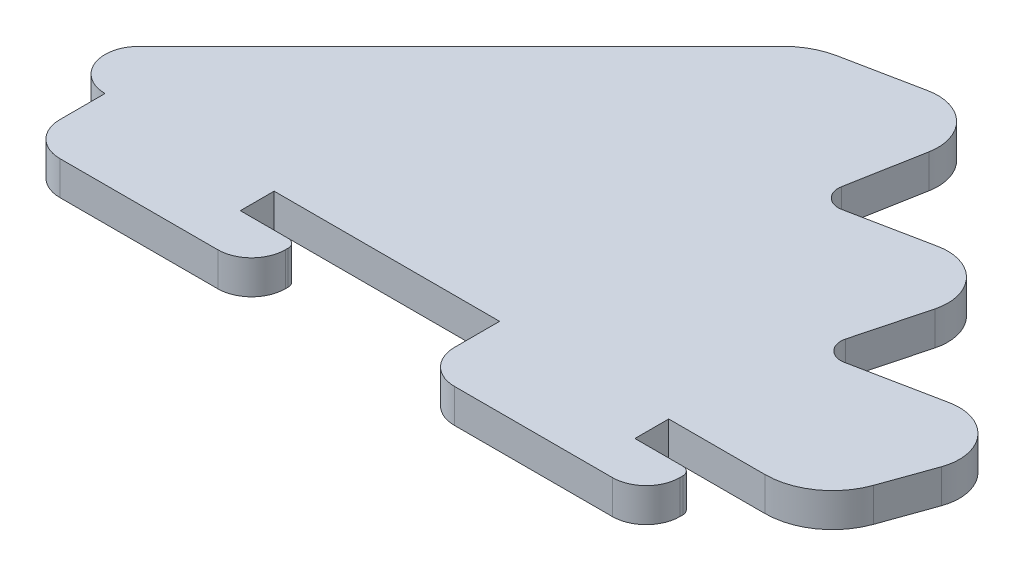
from build123d import *

# Parameters (mm, degrees)
BOSS_EXTRUDE1_DEPTH = 3
FILLET1_R           = 3
FILLET2_R           = 0.75
FILLET3_R           = 3


with BuildPart() as part:
    # Sketch1 → Boss-Extrude1 (new body)
    with BuildSketch(Plane(origin=(0, 0, 0), x_dir=(1, 0, 0), z_dir=(0, 1, 0))):
        with BuildLine():
            Line((22.242640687, 0), (42.242640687, 0))
            Line((42.242640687, 0), (42.242640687, -3))
            Line((42.242640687, -3), (42.242640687, -7))
            Line((42.242640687, -7), (62.242640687, -7))
            Line((62.242640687, -7), (62.242640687, -3))
            Line((62.242640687, -3), (57.242640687, -3))
            Line((57.242640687, -3), (57.242640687, 0))
            Line((57.242640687, 0), (65.770485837, 0))
            ThreePointArc((65.770485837, 0), (69.227431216, 1.095968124), (71.421475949, 3.983490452))
            Line((71.421475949, 3.983490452), (73.009204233, 8.432880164))
            ThreePointArc((73.009204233, 8.432880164), (72.267049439, 12.394152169), (68.453878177, 13.698833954))
            Line((68.453878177, 13.698833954), (60.691945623, 12.139170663))
            ThreePointArc((60.691945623, 12.139170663), (59.30511507, 12.580700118), (58.945710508, 13.991046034))
            Line((58.945710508, 13.991046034), (60.592423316, 20.25679989))
            ThreePointArc((60.592423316, 20.25679989), (59.634011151, 24.017722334), (55.935796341, 25.195134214))
            Line((55.935796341, 25.195134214), (48.835816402, 23.768482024))
            ThreePointArc((48.835816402, 23.768482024), (47.4890411, 24.169124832), (47.064733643, 25.508632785))
            Line((47.064733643, 25.508632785), (48.264380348, 32.075904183))
            ThreePointArc((48.264380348, 32.075904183), (47.132893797, 35.647925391), (43.541492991, 36.716306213))
            Line((43.541492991, 36.716306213), (36.778160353, 35.357299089))
            ThreePointArc((36.778160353, 35.357299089), (35.126628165, 34.763649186), (33.717518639, 33.717518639))
            Line((33.717518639, 33.717518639), (5.121320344, 5.121320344))
            ThreePointArc((5.121320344, 5.121320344), (4.47100209, 1.851949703), (7.242640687, 0))
            Line((7.242640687, 0), (7.242640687, -3))
            Line((7.242640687, -3), (7.242640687, -7))
            Line((7.242640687, -7), (27.242640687, -7))
            Line((27.242640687, -7), (27.242640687, -3))
            Line((27.242640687, -3), (22.242640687, -3))
            Line((22.242640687, -3), (22.242640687, 0))
        make_face()
    extrude(amount=BOSS_EXTRUDE1_DEPTH)

    # Fillet1
    fillet1_edges = [part.edges().sort_by_distance(p)[0] for p in [
        (62.242640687, 1.5, 7),
        (27.242640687, 1.5, 7),
    ]]
    fillet(fillet1_edges, radius=FILLET1_R)

    # Fillet2
    fillet2_edges = [part.edges().sort_by_distance(p)[0] for p in [
        (62.242640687, 1.5, 3),
        (27.242640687, 1.5, 3),
    ]]
    fillet(fillet2_edges, radius=FILLET2_R)

    # Fillet3
    fillet3_edges = [part.edges().sort_by_distance(p)[0] for p in [
        (42.242640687, 1.5, 7),
        (7.242640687, 1.5, 7),
    ]]
    fillet(fillet3_edges, radius=FILLET3_R)


solid = part.part
